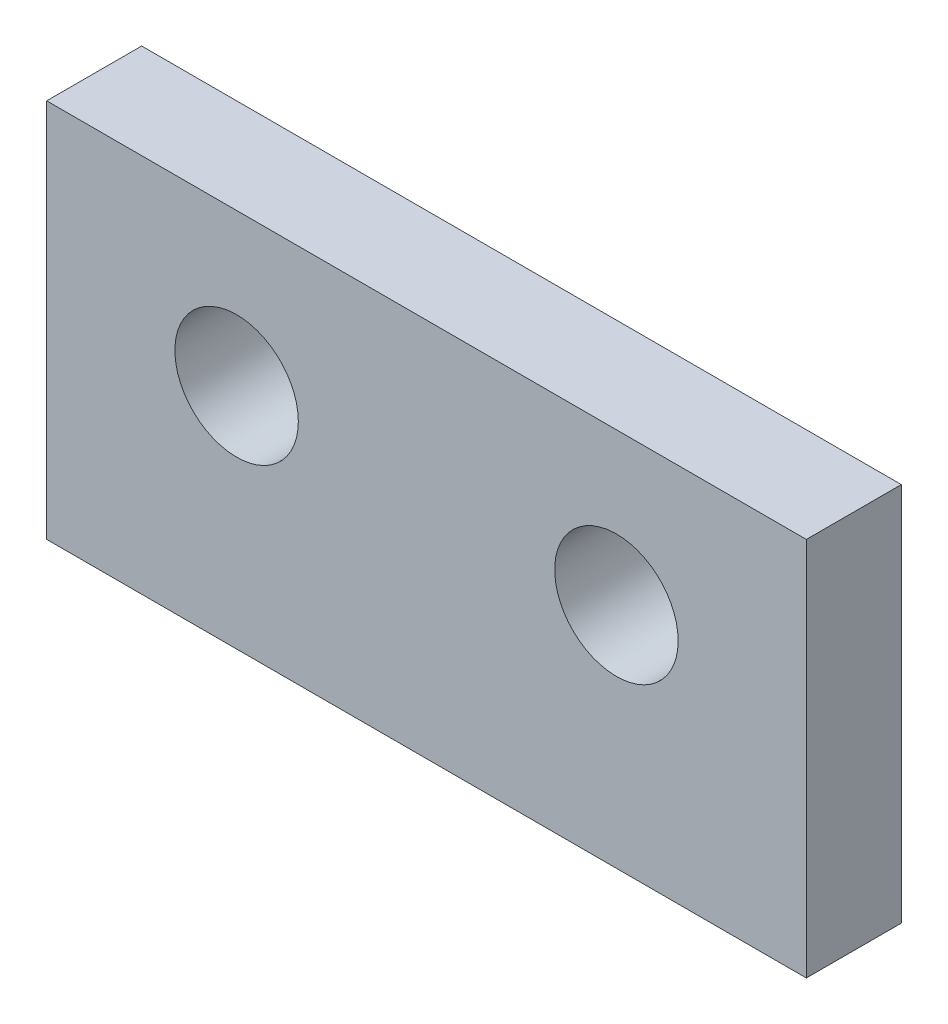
ISO-10303-21;
HEADER;
FILE_DESCRIPTION(('STEP AP214'),'2;1');
FILE_NAME('part.step','',(''),(''),'','','');
FILE_SCHEMA(('AUTOMOTIVE_DESIGN { 1 0 10303 214 1 1 1 1 }'));
ENDSEC;
DATA;
#1=APPLICATION_CONTEXT('core data for automotive mechanical design processes');
#2=APPLICATION_PROTOCOL_DEFINITION('international standard','automotive_design',2000,#1);
#3=PRODUCT_CONTEXT('',#1,'mechanical');
#4=PRODUCT('Part','Part','',(#3));
#5=PRODUCT_RELATED_PRODUCT_CATEGORY('part','',(#4));
#6=PRODUCT_DEFINITION_FORMATION('','',#4);
#7=PRODUCT_DEFINITION_CONTEXT('part definition',#1,'design');
#8=PRODUCT_DEFINITION('design','',#6,#7);
#9=PRODUCT_DEFINITION_SHAPE('','',#8);
#10=(LENGTH_UNIT() NAMED_UNIT(*) SI_UNIT(.MILLI.,.METRE.));
#11=(NAMED_UNIT(*) PLANE_ANGLE_UNIT() SI_UNIT($,.RADIAN.));
#12=(NAMED_UNIT(*) SI_UNIT($,.STERADIAN.) SOLID_ANGLE_UNIT());
#13=UNCERTAINTY_MEASURE_WITH_UNIT(LENGTH_MEASURE(1.E-05),#10,'distance_accuracy_value','');
#14=(GEOMETRIC_REPRESENTATION_CONTEXT(3) GLOBAL_UNCERTAINTY_ASSIGNED_CONTEXT((#13)) GLOBAL_UNIT_ASSIGNED_CONTEXT((#10,
#11,#12)) REPRESENTATION_CONTEXT('',''));
#15=CARTESIAN_POINT('',(0.,0.,0.));
#16=DIRECTION('',(0.,0.,1.));
#17=DIRECTION('',(1.,0.,0.));
#18=AXIS2_PLACEMENT_3D('',#15,#16,#17);
#19=CARTESIAN_POINT('',(0.,0.,0.));
#20=DIRECTION('',(0.,0.,1.));
#21=DIRECTION('',(1.,0.,0.));
#22=AXIS2_PLACEMENT_3D('',#19,#20,#21);
#23=PLANE('',#22);
#24=DIRECTION('',(0.,1.,0.));
#25=VECTOR('',#24,1.);
#26=CARTESIAN_POINT('',(20.,-10.,0.));
#27=LINE('',#26,#25);
#28=CARTESIAN_POINT('',(20.,-10.,0.));
#29=VERTEX_POINT('',#28);
#30=CARTESIAN_POINT('',(20.,10.,0.));
#31=VERTEX_POINT('',#30);
#32=EDGE_CURVE('E188',#29,#31,#27,.T.);
#33=ORIENTED_EDGE('',*,*,#32,.F.);
#34=DIRECTION('',(1.,0.,0.));
#35=VECTOR('',#34,1.);
#36=CARTESIAN_POINT('',(-20.,-10.,0.));
#37=LINE('',#36,#35);
#38=CARTESIAN_POINT('',(-20.,-10.,0.));
#39=VERTEX_POINT('',#38);
#40=EDGE_CURVE('E54',#39,#29,#37,.T.);
#41=ORIENTED_EDGE('',*,*,#40,.F.);
#42=DIRECTION('',(0.,-1.,0.));
#43=VECTOR('',#42,1.);
#44=CARTESIAN_POINT('',(-20.,10.,0.));
#45=LINE('',#44,#43);
#46=CARTESIAN_POINT('',(-20.,10.,0.));
#47=VERTEX_POINT('',#46);
#48=EDGE_CURVE('E56',#47,#39,#45,.T.);
#49=ORIENTED_EDGE('',*,*,#48,.F.);
#50=DIRECTION('',(1.,0.,0.));
#51=VECTOR('',#50,1.);
#52=CARTESIAN_POINT('',(20.,10.,0.));
#53=LINE('',#52,#51);
#54=EDGE_CURVE('E59',#31,#47,#53,.F.);
#55=ORIENTED_EDGE('',*,*,#54,.F.);
#56=EDGE_LOOP('',(#33,#41,#49,#55));
#57=FACE_BOUND('',#56,.T.);
#58=CARTESIAN_POINT('',(10.,2.,0.));
#59=DIRECTION('',(0.,0.,1.));
#60=DIRECTION('',(1.,0.,0.));
#61=AXIS2_PLACEMENT_3D('',#58,#59,#60);
#62=CIRCLE('',#61,3.25);
#63=CARTESIAN_POINT('',(13.25,2.,0.));
#64=VERTEX_POINT('',#63);
#65=EDGE_CURVE('E72',#64,#64,#62,.T.);
#66=ORIENTED_EDGE('',*,*,#65,.T.);
#67=EDGE_LOOP('',(#66));
#68=FACE_BOUND('',#67,.T.);
#69=CARTESIAN_POINT('',(-10.,2.,0.));
#70=DIRECTION('',(0.,0.,1.));
#71=DIRECTION('',(1.,0.,0.));
#72=AXIS2_PLACEMENT_3D('',#69,#70,#71);
#73=CIRCLE('',#72,3.25);
#74=CARTESIAN_POINT('',(-6.75,2.,0.));
#75=VERTEX_POINT('',#74);
#76=EDGE_CURVE('E19',#75,#75,#73,.T.);
#77=ORIENTED_EDGE('',*,*,#76,.T.);
#78=EDGE_LOOP('',(#77));
#79=FACE_BOUND('',#78,.T.);
#80=ADVANCED_FACE('F16',(#57,#68,#79),#23,.F.);
#81=CARTESIAN_POINT('',(-10.,2.,1.));
#82=DIRECTION('',(0.,0.,1.));
#83=DIRECTION('',(1.,0.,0.));
#84=AXIS2_PLACEMENT_3D('',#81,#82,#83);
#85=CYLINDRICAL_SURFACE('',#84,3.25);
#86=CARTESIAN_POINT('',(-10.,2.,5.));
#87=DIRECTION('',(0.,0.,1.));
#88=DIRECTION('',(1.,0.,0.));
#89=AXIS2_PLACEMENT_3D('',#86,#87,#88);
#90=CIRCLE('',#89,3.25);
#91=CARTESIAN_POINT('',(-6.75,2.,5.));
#92=VERTEX_POINT('',#91);
#93=EDGE_CURVE('E87',#92,#92,#90,.F.);
#94=ORIENTED_EDGE('',*,*,#93,.F.);
#95=EDGE_LOOP('',(#94));
#96=FACE_BOUND('',#95,.T.);
#97=ORIENTED_EDGE('',*,*,#76,.F.);
#98=EDGE_LOOP('',(#97));
#99=FACE_BOUND('',#98,.T.);
#100=ADVANCED_FACE('F95',(#96,#99),#85,.F.);
#101=CARTESIAN_POINT('',(10.,2.,1.));
#102=DIRECTION('',(0.,0.,1.));
#103=DIRECTION('',(1.,0.,0.));
#104=AXIS2_PLACEMENT_3D('',#101,#102,#103);
#105=CYLINDRICAL_SURFACE('',#104,3.25);
#106=CARTESIAN_POINT('',(10.,2.,5.));
#107=DIRECTION('',(0.,0.,1.));
#108=DIRECTION('',(1.,0.,0.));
#109=AXIS2_PLACEMENT_3D('',#106,#107,#108);
#110=CIRCLE('',#109,3.25);
#111=CARTESIAN_POINT('',(13.25,2.,5.));
#112=VERTEX_POINT('',#111);
#113=EDGE_CURVE('E83',#112,#112,#110,.F.);
#114=ORIENTED_EDGE('',*,*,#113,.F.);
#115=EDGE_LOOP('',(#114));
#116=FACE_BOUND('',#115,.T.);
#117=ORIENTED_EDGE('',*,*,#65,.F.);
#118=EDGE_LOOP('',(#117));
#119=FACE_BOUND('',#118,.T.);
#120=ADVANCED_FACE('F97',(#116,#119),#105,.F.);
#121=CARTESIAN_POINT('',(20.,10.,0.));
#122=DIRECTION('',(0.,1.,0.));
#123=DIRECTION('',(0.,0.,1.));
#124=AXIS2_PLACEMENT_3D('',#121,#122,#123);
#125=PLANE('',#124);
#126=DIRECTION('',(1.,0.,0.));
#127=VECTOR('',#126,1.);
#128=CARTESIAN_POINT('',(0.,10.,5.));
#129=LINE('',#128,#127);
#130=CARTESIAN_POINT('',(20.,10.,5.));
#131=VERTEX_POINT('',#130);
#132=CARTESIAN_POINT('',(-20.,10.,5.));
#133=VERTEX_POINT('',#132);
#134=EDGE_CURVE('E86',#131,#133,#129,.F.);
#135=ORIENTED_EDGE('',*,*,#134,.F.);
#136=DIRECTION('',(0.,0.,-1.));
#137=VECTOR('',#136,1.);
#138=CARTESIAN_POINT('',(20.,10.,0.));
#139=LINE('',#138,#137);
#140=EDGE_CURVE('E70',#31,#131,#139,.F.);
#141=ORIENTED_EDGE('',*,*,#140,.F.);
#142=ORIENTED_EDGE('',*,*,#54,.T.);
#143=DIRECTION('',(0.,0.,1.));
#144=VECTOR('',#143,1.);
#145=CARTESIAN_POINT('',(-20.,10.,0.));
#146=LINE('',#145,#144);
#147=EDGE_CURVE('E64',#133,#47,#146,.F.);
#148=ORIENTED_EDGE('',*,*,#147,.F.);
#149=EDGE_LOOP('',(#135,#141,#142,#148));
#150=FACE_BOUND('',#149,.T.);
#151=ADVANCED_FACE('F67',(#150),#125,.T.);
#152=CARTESIAN_POINT('',(-20.,10.,0.));
#153=DIRECTION('',(-1.,0.,0.));
#154=DIRECTION('',(0.,-1.,0.));
#155=AXIS2_PLACEMENT_3D('',#152,#153,#154);
#156=PLANE('',#155);
#157=DIRECTION('',(0.,1.,0.));
#158=VECTOR('',#157,1.);
#159=CARTESIAN_POINT('',(-20.,0.,5.));
#160=LINE('',#159,#158);
#161=CARTESIAN_POINT('',(-20.,-10.,5.));
#162=VERTEX_POINT('',#161);
#163=EDGE_CURVE('E76',#133,#162,#160,.F.);
#164=ORIENTED_EDGE('',*,*,#163,.F.);
#165=ORIENTED_EDGE('',*,*,#147,.T.);
#166=ORIENTED_EDGE('',*,*,#48,.T.);
#167=DIRECTION('',(0.,0.,1.));
#168=VECTOR('',#167,1.);
#169=CARTESIAN_POINT('',(-20.,-10.,0.));
#170=LINE('',#169,#168);
#171=EDGE_CURVE('E79',#162,#39,#170,.F.);
#172=ORIENTED_EDGE('',*,*,#171,.F.);
#173=EDGE_LOOP('',(#164,#165,#166,#172));
#174=FACE_BOUND('',#173,.T.);
#175=ADVANCED_FACE('F74',(#174),#156,.T.);
#176=CARTESIAN_POINT('',(-20.,-10.,0.));
#177=DIRECTION('',(0.,-1.,0.));
#178=DIRECTION('',(1.,0.,0.));
#179=AXIS2_PLACEMENT_3D('',#176,#177,#178);
#180=PLANE('',#179);
#181=DIRECTION('',(1.,0.,0.));
#182=VECTOR('',#181,1.);
#183=CARTESIAN_POINT('',(0.,-10.,5.));
#184=LINE('',#183,#182);
#185=CARTESIAN_POINT('',(20.,-10.,5.));
#186=VERTEX_POINT('',#185);
#187=EDGE_CURVE('E25',#162,#186,#184,.T.);
#188=ORIENTED_EDGE('',*,*,#187,.F.);
#189=ORIENTED_EDGE('',*,*,#171,.T.);
#190=ORIENTED_EDGE('',*,*,#40,.T.);
#191=DIRECTION('',(0.,0.,-1.));
#192=VECTOR('',#191,1.);
#193=CARTESIAN_POINT('',(20.,-10.,0.));
#194=LINE('',#193,#192);
#195=EDGE_CURVE('E34',#186,#29,#194,.T.);
#196=ORIENTED_EDGE('',*,*,#195,.F.);
#197=EDGE_LOOP('',(#188,#189,#190,#196));
#198=FACE_BOUND('',#197,.T.);
#199=ADVANCED_FACE('F115',(#198),#180,.T.);
#200=CARTESIAN_POINT('',(20.,-10.,0.));
#201=DIRECTION('',(1.,0.,0.));
#202=DIRECTION('',(0.,0.,-1.));
#203=AXIS2_PLACEMENT_3D('',#200,#201,#202);
#204=PLANE('',#203);
#205=DIRECTION('',(0.,1.,0.));
#206=VECTOR('',#205,1.);
#207=CARTESIAN_POINT('',(20.,0.,5.));
#208=LINE('',#207,#206);
#209=EDGE_CURVE('E11',#186,#131,#208,.T.);
#210=ORIENTED_EDGE('',*,*,#209,.F.);
#211=ORIENTED_EDGE('',*,*,#195,.T.);
#212=ORIENTED_EDGE('',*,*,#32,.T.);
#213=ORIENTED_EDGE('',*,*,#140,.T.);
#214=EDGE_LOOP('',(#210,#211,#212,#213));
#215=FACE_BOUND('',#214,.T.);
#216=ADVANCED_FACE('F109',(#215),#204,.T.);
#217=CARTESIAN_POINT('',(0.,0.,5.));
#218=DIRECTION('',(0.,0.,1.));
#219=DIRECTION('',(1.,0.,0.));
#220=AXIS2_PLACEMENT_3D('',#217,#218,#219);
#221=PLANE('',#220);
#222=ORIENTED_EDGE('',*,*,#187,.T.);
#223=ORIENTED_EDGE('',*,*,#209,.T.);
#224=ORIENTED_EDGE('',*,*,#134,.T.);
#225=ORIENTED_EDGE('',*,*,#163,.T.);
#226=EDGE_LOOP('',(#222,#223,#224,#225));
#227=FACE_BOUND('',#226,.T.);
#228=ORIENTED_EDGE('',*,*,#113,.T.);
#229=EDGE_LOOP('',(#228));
#230=FACE_BOUND('',#229,.T.);
#231=ORIENTED_EDGE('',*,*,#93,.T.);
#232=EDGE_LOOP('',(#231));
#233=FACE_BOUND('',#232,.T.);
#234=ADVANCED_FACE('F107',(#227,#230,#233),#221,.T.);
#235=CLOSED_SHELL('',(#80,#100,#120,#151,#175,#199,#216,#234));
#236=MANIFOLD_SOLID_BREP('B1',#235);
#237=ADVANCED_BREP_SHAPE_REPRESENTATION('',(#18,#236),#14);
#238=SHAPE_DEFINITION_REPRESENTATION(#9,#237);
ENDSEC;
END-ISO-10303-21;
